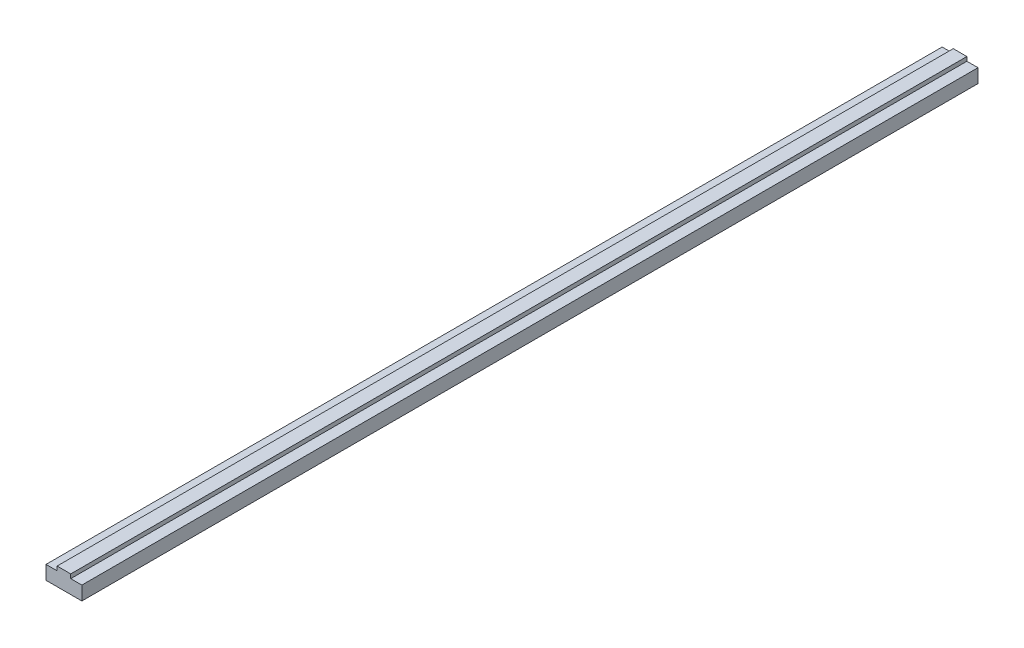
ISO-10303-21;
HEADER;
FILE_DESCRIPTION(('STEP AP214'),'2;1');
FILE_NAME('part.step','',(''),(''),'','','');
FILE_SCHEMA(('AUTOMOTIVE_DESIGN { 1 0 10303 214 1 1 1 1 }'));
ENDSEC;
DATA;
#1=APPLICATION_CONTEXT('core data for automotive mechanical design processes');
#2=APPLICATION_PROTOCOL_DEFINITION('international standard','automotive_design',2000,#1);
#3=PRODUCT_CONTEXT('',#1,'mechanical');
#4=PRODUCT('Part','Part','',(#3));
#5=PRODUCT_RELATED_PRODUCT_CATEGORY('part','',(#4));
#6=PRODUCT_DEFINITION_FORMATION('','',#4);
#7=PRODUCT_DEFINITION_CONTEXT('part definition',#1,'design');
#8=PRODUCT_DEFINITION('design','',#6,#7);
#9=PRODUCT_DEFINITION_SHAPE('','',#8);
#10=(LENGTH_UNIT() NAMED_UNIT(*) SI_UNIT(.MILLI.,.METRE.));
#11=(NAMED_UNIT(*) PLANE_ANGLE_UNIT() SI_UNIT($,.RADIAN.));
#12=(NAMED_UNIT(*) SI_UNIT($,.STERADIAN.) SOLID_ANGLE_UNIT());
#13=UNCERTAINTY_MEASURE_WITH_UNIT(LENGTH_MEASURE(1.E-05),#10,'distance_accuracy_value','');
#14=(GEOMETRIC_REPRESENTATION_CONTEXT(3) GLOBAL_UNCERTAINTY_ASSIGNED_CONTEXT((#13)) GLOBAL_UNIT_ASSIGNED_CONTEXT((#10,
#11,#12)) REPRESENTATION_CONTEXT('',''));
#15=CARTESIAN_POINT('',(0.,0.,0.));
#16=DIRECTION('',(0.,0.,1.));
#17=DIRECTION('',(1.,0.,0.));
#18=AXIS2_PLACEMENT_3D('',#15,#16,#17);
#19=CARTESIAN_POINT('',(-3.79999999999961,10.,0.));
#20=DIRECTION('',(-1.,0.,0.));
#21=DIRECTION('',(0.,-1.,0.));
#22=AXIS2_PLACEMENT_3D('',#19,#20,#21);
#23=PLANE('',#22);
#24=DIRECTION('',(0.,-1.,0.));
#25=VECTOR('',#24,1.);
#26=CARTESIAN_POINT('',(-3.79999999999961,10.,500.));
#27=LINE('',#26,#25);
#28=CARTESIAN_POINT('',(-3.79999999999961,10.,500.));
#29=VERTEX_POINT('',#28);
#30=CARTESIAN_POINT('',(-3.79999999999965,7.69999999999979,500.));
#31=VERTEX_POINT('',#30);
#32=EDGE_CURVE('E112',#29,#31,#27,.T.);
#33=ORIENTED_EDGE('',*,*,#32,.F.);
#34=DIRECTION('',(0.,0.,1.));
#35=VECTOR('',#34,1.);
#36=CARTESIAN_POINT('',(-3.79999999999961,10.,0.));
#37=LINE('',#36,#35);
#38=CARTESIAN_POINT('',(-3.79999999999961,10.,0.));
#39=VERTEX_POINT('',#38);
#40=EDGE_CURVE('E9',#39,#29,#37,.T.);
#41=ORIENTED_EDGE('',*,*,#40,.F.);
#42=DIRECTION('',(0.,-1.,0.));
#43=VECTOR('',#42,1.);
#44=CARTESIAN_POINT('',(-3.79999999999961,10.,0.));
#45=LINE('',#44,#43);
#46=CARTESIAN_POINT('',(-3.79999999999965,7.69999999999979,0.));
#47=VERTEX_POINT('',#46);
#48=EDGE_CURVE('E130',#39,#47,#45,.T.);
#49=ORIENTED_EDGE('',*,*,#48,.T.);
#50=DIRECTION('',(0.,0.,1.));
#51=VECTOR('',#50,1.);
#52=CARTESIAN_POINT('',(-3.79999999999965,7.69999999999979,0.));
#53=LINE('',#52,#51);
#54=EDGE_CURVE('E17',#47,#31,#53,.T.);
#55=ORIENTED_EDGE('',*,*,#54,.T.);
#56=EDGE_LOOP('',(#33,#41,#49,#55));
#57=FACE_BOUND('',#56,.T.);
#58=ADVANCED_FACE('F14',(#57),#23,.T.);
#59=CARTESIAN_POINT('',(-3.79999999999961,10.,0.));
#60=DIRECTION('',(0.,-1.,0.));
#61=DIRECTION('',(0.,0.,-1.));
#62=AXIS2_PLACEMENT_3D('',#59,#60,#61);
#63=PLANE('',#62);
#64=DIRECTION('',(1.,0.,0.));
#65=VECTOR('',#64,1.);
#66=CARTESIAN_POINT('',(-3.79999999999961,10.,500.));
#67=LINE('',#66,#65);
#68=CARTESIAN_POINT('',(3.79999999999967,10.,500.));
#69=VERTEX_POINT('',#68);
#70=EDGE_CURVE('E59',#29,#69,#67,.T.);
#71=ORIENTED_EDGE('',*,*,#70,.T.);
#72=DIRECTION('',(0.,0.,1.));
#73=VECTOR('',#72,1.);
#74=CARTESIAN_POINT('',(3.79999999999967,10.,0.));
#75=LINE('',#74,#73);
#76=CARTESIAN_POINT('',(3.79999999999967,10.,0.));
#77=VERTEX_POINT('',#76);
#78=EDGE_CURVE('E23',#77,#69,#75,.T.);
#79=ORIENTED_EDGE('',*,*,#78,.F.);
#80=DIRECTION('',(1.,0.,0.));
#81=VECTOR('',#80,1.);
#82=CARTESIAN_POINT('',(-3.79999999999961,10.,0.));
#83=LINE('',#82,#81);
#84=EDGE_CURVE('E90',#39,#77,#83,.T.);
#85=ORIENTED_EDGE('',*,*,#84,.F.);
#86=ORIENTED_EDGE('',*,*,#40,.T.);
#87=EDGE_LOOP('',(#71,#79,#85,#86));
#88=FACE_BOUND('',#87,.T.);
#89=ADVANCED_FACE('F171',(#88),#63,.F.);
#90=CARTESIAN_POINT('',(3.79999999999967,10.,0.));
#91=DIRECTION('',(-1.,0.,0.));
#92=DIRECTION('',(0.,-1.,0.));
#93=AXIS2_PLACEMENT_3D('',#90,#91,#92);
#94=PLANE('',#93);
#95=DIRECTION('',(0.,-1.,0.));
#96=VECTOR('',#95,1.);
#97=CARTESIAN_POINT('',(3.79999999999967,10.,500.));
#98=LINE('',#97,#96);
#99=CARTESIAN_POINT('',(3.7999999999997,7.69999999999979,500.));
#100=VERTEX_POINT('',#99);
#101=EDGE_CURVE('E97',#69,#100,#98,.T.);
#102=ORIENTED_EDGE('',*,*,#101,.T.);
#103=DIRECTION('',(0.,0.,1.));
#104=VECTOR('',#103,1.);
#105=CARTESIAN_POINT('',(3.7999999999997,7.69999999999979,0.));
#106=LINE('',#105,#104);
#107=CARTESIAN_POINT('',(3.7999999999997,7.69999999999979,0.));
#108=VERTEX_POINT('',#107);
#109=EDGE_CURVE('E94',#108,#100,#106,.T.);
#110=ORIENTED_EDGE('',*,*,#109,.F.);
#111=DIRECTION('',(0.,-1.,0.));
#112=VECTOR('',#111,1.);
#113=CARTESIAN_POINT('',(3.79999999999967,10.,0.));
#114=LINE('',#113,#112);
#115=EDGE_CURVE('E83',#77,#108,#114,.T.);
#116=ORIENTED_EDGE('',*,*,#115,.F.);
#117=ORIENTED_EDGE('',*,*,#78,.T.);
#118=EDGE_LOOP('',(#102,#110,#116,#117));
#119=FACE_BOUND('',#118,.T.);
#120=ADVANCED_FACE('F95',(#119),#94,.F.);
#121=CARTESIAN_POINT('',(3.7999999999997,7.69999999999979,0.));
#122=DIRECTION('',(0.,-1.,0.));
#123=DIRECTION('',(0.,0.,-1.));
#124=AXIS2_PLACEMENT_3D('',#121,#122,#123);
#125=PLANE('',#124);
#126=DIRECTION('',(1.,0.,0.));
#127=VECTOR('',#126,1.);
#128=CARTESIAN_POINT('',(3.7999999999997,7.69999999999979,500.));
#129=LINE('',#128,#127);
#130=CARTESIAN_POINT('',(10.,7.69999999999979,500.));
#131=VERTEX_POINT('',#130);
#132=EDGE_CURVE('E127',#100,#131,#129,.T.);
#133=ORIENTED_EDGE('',*,*,#132,.T.);
#134=DIRECTION('',(0.,0.,1.));
#135=VECTOR('',#134,1.);
#136=CARTESIAN_POINT('',(10.,7.69999999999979,0.));
#137=LINE('',#136,#135);
#138=CARTESIAN_POINT('',(10.,7.69999999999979,0.));
#139=VERTEX_POINT('',#138);
#140=EDGE_CURVE('E100',#139,#131,#137,.T.);
#141=ORIENTED_EDGE('',*,*,#140,.F.);
#142=DIRECTION('',(1.,0.,0.));
#143=VECTOR('',#142,1.);
#144=CARTESIAN_POINT('',(3.7999999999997,7.69999999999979,0.));
#145=LINE('',#144,#143);
#146=EDGE_CURVE('E88',#108,#139,#145,.T.);
#147=ORIENTED_EDGE('',*,*,#146,.F.);
#148=ORIENTED_EDGE('',*,*,#109,.T.);
#149=EDGE_LOOP('',(#133,#141,#147,#148));
#150=FACE_BOUND('',#149,.T.);
#151=ADVANCED_FACE('F102',(#150),#125,.F.);
#152=CARTESIAN_POINT('',(10.,7.69999999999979,0.));
#153=DIRECTION('',(-1.,0.,0.));
#154=DIRECTION('',(0.,0.,1.));
#155=AXIS2_PLACEMENT_3D('',#152,#153,#154);
#156=PLANE('',#155);
#157=DIRECTION('',(0.,-1.,0.));
#158=VECTOR('',#157,1.);
#159=CARTESIAN_POINT('',(10.,7.69999999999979,500.));
#160=LINE('',#159,#158);
#161=CARTESIAN_POINT('',(10.,0.,500.));
#162=VERTEX_POINT('',#161);
#163=EDGE_CURVE('E124',#131,#162,#160,.T.);
#164=ORIENTED_EDGE('',*,*,#163,.T.);
#165=DIRECTION('',(0.,0.,1.));
#166=VECTOR('',#165,1.);
#167=CARTESIAN_POINT('',(10.,0.,0.));
#168=LINE('',#167,#166);
#169=CARTESIAN_POINT('',(10.,0.,0.));
#170=VERTEX_POINT('',#169);
#171=EDGE_CURVE('E134',#170,#162,#168,.T.);
#172=ORIENTED_EDGE('',*,*,#171,.F.);
#173=DIRECTION('',(0.,-1.,0.));
#174=VECTOR('',#173,1.);
#175=CARTESIAN_POINT('',(10.,7.69999999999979,0.));
#176=LINE('',#175,#174);
#177=EDGE_CURVE('E105',#139,#170,#176,.T.);
#178=ORIENTED_EDGE('',*,*,#177,.F.);
#179=ORIENTED_EDGE('',*,*,#140,.T.);
#180=EDGE_LOOP('',(#164,#172,#178,#179));
#181=FACE_BOUND('',#180,.T.);
#182=ADVANCED_FACE('F144',(#181),#156,.F.);
#183=CARTESIAN_POINT('',(-10.,0.,0.));
#184=DIRECTION('',(0.,-1.,0.));
#185=DIRECTION('',(0.,0.,-1.));
#186=AXIS2_PLACEMENT_3D('',#183,#184,#185);
#187=PLANE('',#186);
#188=DIRECTION('',(1.,0.,0.));
#189=VECTOR('',#188,1.);
#190=CARTESIAN_POINT('',(-10.,0.,500.));
#191=LINE('',#190,#189);
#192=CARTESIAN_POINT('',(-10.,0.,500.));
#193=VERTEX_POINT('',#192);
#194=EDGE_CURVE('E121',#193,#162,#191,.T.);
#195=ORIENTED_EDGE('',*,*,#194,.F.);
#196=DIRECTION('',(0.,0.,1.));
#197=VECTOR('',#196,1.);
#198=CARTESIAN_POINT('',(-10.,0.,0.));
#199=LINE('',#198,#197);
#200=CARTESIAN_POINT('',(-10.,0.,0.));
#201=VERTEX_POINT('',#200);
#202=EDGE_CURVE('E136',#201,#193,#199,.T.);
#203=ORIENTED_EDGE('',*,*,#202,.F.);
#204=DIRECTION('',(1.,0.,0.));
#205=VECTOR('',#204,1.);
#206=CARTESIAN_POINT('',(-10.,0.,0.));
#207=LINE('',#206,#205);
#208=EDGE_CURVE('E107',#201,#170,#207,.T.);
#209=ORIENTED_EDGE('',*,*,#208,.T.);
#210=ORIENTED_EDGE('',*,*,#171,.T.);
#211=EDGE_LOOP('',(#195,#203,#209,#210));
#212=FACE_BOUND('',#211,.T.);
#213=ADVANCED_FACE('F159',(#212),#187,.T.);
#214=CARTESIAN_POINT('',(-10.,7.69999999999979,0.));
#215=DIRECTION('',(-1.,0.,0.));
#216=DIRECTION('',(0.,-1.,0.));
#217=AXIS2_PLACEMENT_3D('',#214,#215,#216);
#218=PLANE('',#217);
#219=DIRECTION('',(0.,-1.,0.));
#220=VECTOR('',#219,1.);
#221=CARTESIAN_POINT('',(-10.,7.69999999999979,500.));
#222=LINE('',#221,#220);
#223=CARTESIAN_POINT('',(-10.,7.69999999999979,500.));
#224=VERTEX_POINT('',#223);
#225=EDGE_CURVE('E118',#224,#193,#222,.T.);
#226=ORIENTED_EDGE('',*,*,#225,.F.);
#227=DIRECTION('',(0.,0.,1.));
#228=VECTOR('',#227,1.);
#229=CARTESIAN_POINT('',(-10.,7.69999999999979,0.));
#230=LINE('',#229,#228);
#231=CARTESIAN_POINT('',(-10.,7.69999999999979,0.));
#232=VERTEX_POINT('',#231);
#233=EDGE_CURVE('E137',#232,#224,#230,.T.);
#234=ORIENTED_EDGE('',*,*,#233,.F.);
#235=DIRECTION('',(0.,-1.,0.));
#236=VECTOR('',#235,1.);
#237=CARTESIAN_POINT('',(-10.,7.69999999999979,0.));
#238=LINE('',#237,#236);
#239=EDGE_CURVE('E150',#232,#201,#238,.T.);
#240=ORIENTED_EDGE('',*,*,#239,.T.);
#241=ORIENTED_EDGE('',*,*,#202,.T.);
#242=EDGE_LOOP('',(#226,#234,#240,#241));
#243=FACE_BOUND('',#242,.T.);
#244=ADVANCED_FACE('F153',(#243),#218,.T.);
#245=CARTESIAN_POINT('',(-3.79999999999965,7.69999999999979,0.));
#246=DIRECTION('',(0.,1.,0.));
#247=DIRECTION('',(0.,0.,1.));
#248=AXIS2_PLACEMENT_3D('',#245,#246,#247);
#249=PLANE('',#248);
#250=DIRECTION('',(-1.,0.,0.));
#251=VECTOR('',#250,1.);
#252=CARTESIAN_POINT('',(-3.79999999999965,7.69999999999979,500.));
#253=LINE('',#252,#251);
#254=EDGE_CURVE('E115',#31,#224,#253,.T.);
#255=ORIENTED_EDGE('',*,*,#254,.F.);
#256=ORIENTED_EDGE('',*,*,#54,.F.);
#257=DIRECTION('',(-1.,0.,0.));
#258=VECTOR('',#257,1.);
#259=CARTESIAN_POINT('',(-3.79999999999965,7.69999999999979,0.));
#260=LINE('',#259,#258);
#261=EDGE_CURVE('E155',#47,#232,#260,.T.);
#262=ORIENTED_EDGE('',*,*,#261,.T.);
#263=ORIENTED_EDGE('',*,*,#233,.T.);
#264=EDGE_LOOP('',(#255,#256,#262,#263));
#265=FACE_BOUND('',#264,.T.);
#266=ADVANCED_FACE('F139',(#265),#249,.T.);
#267=CARTESIAN_POINT('',(-3.79999999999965,7.69999999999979,0.));
#268=DIRECTION('',(0.,0.,-1.));
#269=DIRECTION('',(-1.,0.,0.));
#270=AXIS2_PLACEMENT_3D('',#267,#268,#269);
#271=PLANE('',#270);
#272=ORIENTED_EDGE('',*,*,#48,.F.);
#273=ORIENTED_EDGE('',*,*,#84,.T.);
#274=ORIENTED_EDGE('',*,*,#115,.T.);
#275=ORIENTED_EDGE('',*,*,#146,.T.);
#276=ORIENTED_EDGE('',*,*,#177,.T.);
#277=ORIENTED_EDGE('',*,*,#208,.F.);
#278=ORIENTED_EDGE('',*,*,#239,.F.);
#279=ORIENTED_EDGE('',*,*,#261,.F.);
#280=EDGE_LOOP('',(#272,#273,#274,#275,#276,#277,#278,#279));
#281=FACE_BOUND('',#280,.T.);
#282=ADVANCED_FACE('F86',(#281),#271,.T.);
#283=CARTESIAN_POINT('',(-3.79999999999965,7.69999999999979,500.));
#284=DIRECTION('',(0.,0.,-1.));
#285=DIRECTION('',(-1.,0.,0.));
#286=AXIS2_PLACEMENT_3D('',#283,#284,#285);
#287=PLANE('',#286);
#288=ORIENTED_EDGE('',*,*,#32,.T.);
#289=ORIENTED_EDGE('',*,*,#254,.T.);
#290=ORIENTED_EDGE('',*,*,#225,.T.);
#291=ORIENTED_EDGE('',*,*,#194,.T.);
#292=ORIENTED_EDGE('',*,*,#163,.F.);
#293=ORIENTED_EDGE('',*,*,#132,.F.);
#294=ORIENTED_EDGE('',*,*,#101,.F.);
#295=ORIENTED_EDGE('',*,*,#70,.F.);
#296=EDGE_LOOP('',(#288,#289,#290,#291,#292,#293,#294,#295));
#297=FACE_BOUND('',#296,.T.);
#298=ADVANCED_FACE('F141',(#297),#287,.F.);
#299=CLOSED_SHELL('',(#58,#89,#120,#151,#182,#213,#244,#266,#282,#298));
#300=MANIFOLD_SOLID_BREP('B1',#299);
#301=ADVANCED_BREP_SHAPE_REPRESENTATION('',(#18,#300),#14);
#302=SHAPE_DEFINITION_REPRESENTATION(#9,#301);
ENDSEC;
END-ISO-10303-21;
